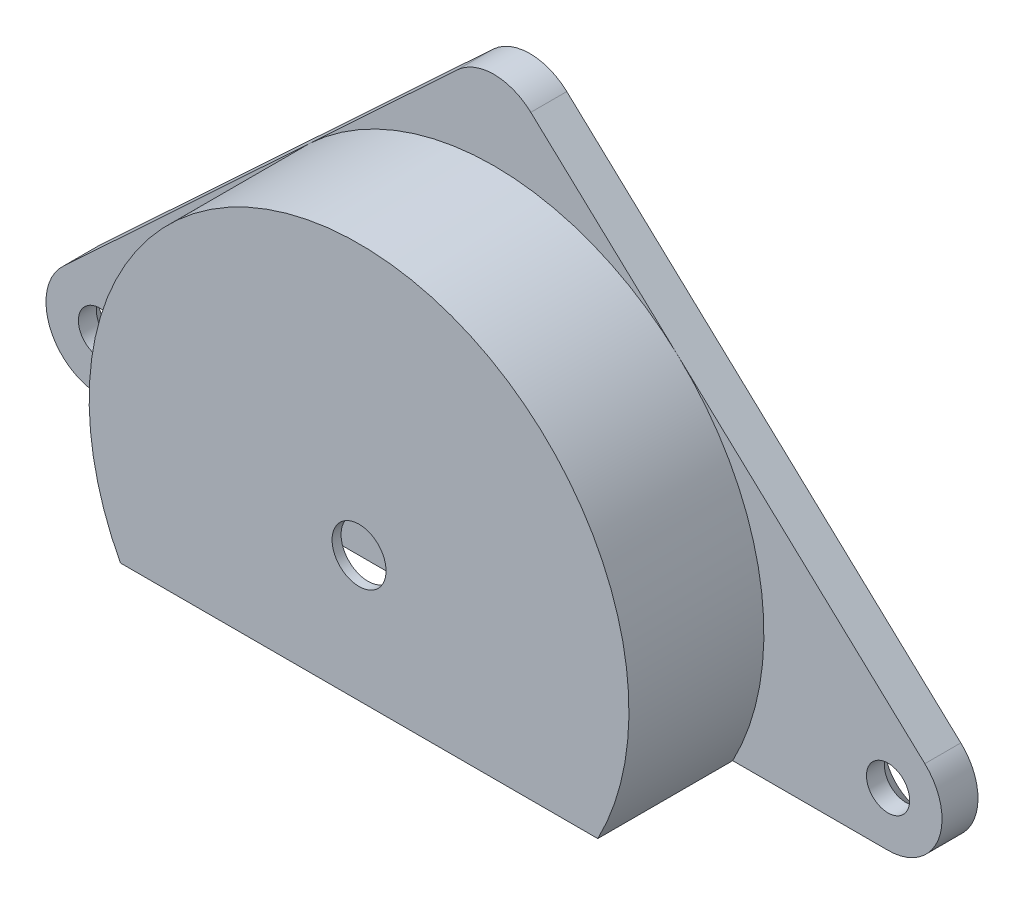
ISO-10303-21;
HEADER;
FILE_DESCRIPTION(('STEP AP214'),'2;1');
FILE_NAME('part.step','',(''),(''),'','','');
FILE_SCHEMA(('AUTOMOTIVE_DESIGN { 1 0 10303 214 1 1 1 1 }'));
ENDSEC;
DATA;
#1=APPLICATION_CONTEXT('core data for automotive mechanical design processes');
#2=APPLICATION_PROTOCOL_DEFINITION('international standard','automotive_design',2000,#1);
#3=PRODUCT_CONTEXT('',#1,'mechanical');
#4=PRODUCT('Part','Part','',(#3));
#5=PRODUCT_RELATED_PRODUCT_CATEGORY('part','',(#4));
#6=PRODUCT_DEFINITION_FORMATION('','',#4);
#7=PRODUCT_DEFINITION_CONTEXT('part definition',#1,'design');
#8=PRODUCT_DEFINITION('design','',#6,#7);
#9=PRODUCT_DEFINITION_SHAPE('','',#8);
#10=(LENGTH_UNIT() NAMED_UNIT(*) SI_UNIT(.MILLI.,.METRE.));
#11=(NAMED_UNIT(*) PLANE_ANGLE_UNIT() SI_UNIT($,.RADIAN.));
#12=(NAMED_UNIT(*) SI_UNIT($,.STERADIAN.) SOLID_ANGLE_UNIT());
#13=UNCERTAINTY_MEASURE_WITH_UNIT(LENGTH_MEASURE(1.E-05),#10,'distance_accuracy_value','');
#14=(GEOMETRIC_REPRESENTATION_CONTEXT(3) GLOBAL_UNCERTAINTY_ASSIGNED_CONTEXT((#13)) GLOBAL_UNIT_ASSIGNED_CONTEXT((#10,
#11,#12)) REPRESENTATION_CONTEXT('',''));
#15=CARTESIAN_POINT('',(0.,0.,0.));
#16=DIRECTION('',(0.,0.,1.));
#17=DIRECTION('',(1.,0.,0.));
#18=AXIS2_PLACEMENT_3D('',#15,#16,#17);
#19=CARTESIAN_POINT('',(-13.2664991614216,-7.,-3.75));
#20=DIRECTION('',(0.,1.,0.));
#21=DIRECTION('',(0.,0.,1.));
#22=AXIS2_PLACEMENT_3D('',#19,#20,#21);
#23=PLANE('',#22);
#24=DIRECTION('',(-1.,0.,0.));
#25=VECTOR('',#24,1.);
#26=CARTESIAN_POINT('',(29.5208210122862,-7.,-3.75));
#27=LINE('',#26,#25);
#28=CARTESIAN_POINT('',(-13.2664991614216,-7.,-3.75));
#29=VERTEX_POINT('',#28);
#30=CARTESIAN_POINT('',(-21.8990817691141,-7.,-3.75));
#31=VERTEX_POINT('',#30);
#32=EDGE_CURVE('E140',#29,#31,#27,.T.);
#33=ORIENTED_EDGE('',*,*,#32,.T.);
#34=DIRECTION('',(0.,0.,1.));
#35=VECTOR('',#34,1.);
#36=CARTESIAN_POINT('',(-21.8990817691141,-7.,-3.75));
#37=LINE('',#36,#35);
#38=CARTESIAN_POINT('',(-21.8990817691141,-7.,-5.75));
#39=VERTEX_POINT('',#38);
#40=EDGE_CURVE('E52',#31,#39,#37,.F.);
#41=ORIENTED_EDGE('',*,*,#40,.T.);
#42=DIRECTION('',(-1.,0.,0.));
#43=VECTOR('',#42,1.);
#44=CARTESIAN_POINT('',(29.5208210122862,-7.,-5.75));
#45=LINE('',#44,#43);
#46=CARTESIAN_POINT('',(21.8990817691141,-7.,-5.75));
#47=VERTEX_POINT('',#46);
#48=EDGE_CURVE('E187',#47,#39,#45,.T.);
#49=ORIENTED_EDGE('',*,*,#48,.F.);
#50=DIRECTION('',(0.,0.,1.));
#51=VECTOR('',#50,1.);
#52=CARTESIAN_POINT('',(21.8990817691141,-7.,-3.75));
#53=LINE('',#52,#51);
#54=CARTESIAN_POINT('',(21.8990817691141,-7.,-3.75));
#55=VERTEX_POINT('',#54);
#56=EDGE_CURVE('E181',#47,#55,#53,.T.);
#57=ORIENTED_EDGE('',*,*,#56,.T.);
#58=CARTESIAN_POINT('',(13.2664991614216,-7.,-3.75));
#59=VERTEX_POINT('',#58);
#60=EDGE_CURVE('E254',#55,#59,#27,.T.);
#61=ORIENTED_EDGE('',*,*,#60,.T.);
#62=DIRECTION('',(0.,0.,1.));
#63=VECTOR('',#62,1.);
#64=CARTESIAN_POINT('',(13.2664991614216,-7.,-3.75));
#65=LINE('',#64,#63);
#66=CARTESIAN_POINT('',(13.2664991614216,-7.,3.75));
#67=VERTEX_POINT('',#66);
#68=EDGE_CURVE('E235',#59,#67,#65,.T.);
#69=ORIENTED_EDGE('',*,*,#68,.T.);
#70=DIRECTION('',(-1.,0.,0.));
#71=VECTOR('',#70,1.);
#72=CARTESIAN_POINT('',(-13.2664991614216,-7.,3.75));
#73=LINE('',#72,#71);
#74=CARTESIAN_POINT('',(-13.2664991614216,-7.,3.75));
#75=VERTEX_POINT('',#74);
#76=EDGE_CURVE('E234',#67,#75,#73,.T.);
#77=ORIENTED_EDGE('',*,*,#76,.T.);
#78=DIRECTION('',(0.,0.,1.));
#79=VECTOR('',#78,1.);
#80=CARTESIAN_POINT('',(-13.2664991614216,-7.,-3.75));
#81=LINE('',#80,#79);
#82=EDGE_CURVE('E146',#29,#75,#81,.T.);
#83=ORIENTED_EDGE('',*,*,#82,.F.);
#84=EDGE_LOOP('',(#33,#41,#49,#57,#61,#69,#77,#83));
#85=FACE_BOUND('',#84,.T.);
#86=DIRECTION('',(-1.,0.,0.));
#87=VECTOR('',#86,1.);
#88=CARTESIAN_POINT('',(0.,-7.,3.25));
#89=LINE('',#88,#87);
#90=CARTESIAN_POINT('',(12.6984250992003,-7.,3.25));
#91=VERTEX_POINT('',#90);
#92=CARTESIAN_POINT('',(-12.6984250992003,-7.,3.25));
#93=VERTEX_POINT('',#92);
#94=EDGE_CURVE('E195',#91,#93,#89,.T.);
#95=ORIENTED_EDGE('',*,*,#94,.F.);
#96=DIRECTION('',(0.,0.,-1.));
#97=VECTOR('',#96,1.);
#98=CARTESIAN_POINT('',(12.6984250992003,-7.,-3.25));
#99=LINE('',#98,#97);
#100=CARTESIAN_POINT('',(12.6984250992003,-7.,-3.25));
#101=VERTEX_POINT('',#100);
#102=EDGE_CURVE('E243',#101,#91,#99,.F.);
#103=ORIENTED_EDGE('',*,*,#102,.F.);
#104=DIRECTION('',(-1.,0.,0.));
#105=VECTOR('',#104,1.);
#106=CARTESIAN_POINT('',(0.,-7.,-3.25));
#107=LINE('',#106,#105);
#108=CARTESIAN_POINT('',(-12.6984250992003,-7.,-3.25));
#109=VERTEX_POINT('',#108);
#110=EDGE_CURVE('E240',#101,#109,#107,.T.);
#111=ORIENTED_EDGE('',*,*,#110,.T.);
#112=DIRECTION('',(0.,0.,-1.));
#113=VECTOR('',#112,1.);
#114=CARTESIAN_POINT('',(-12.6984250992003,-7.,-3.25));
#115=LINE('',#114,#113);
#116=EDGE_CURVE('E244',#109,#93,#115,.F.);
#117=ORIENTED_EDGE('',*,*,#116,.T.);
#118=EDGE_LOOP('',(#95,#103,#111,#117));
#119=FACE_BOUND('',#118,.T.);
#120=ADVANCED_FACE('F44',(#85,#119),#23,.F.);
#121=CARTESIAN_POINT('',(0.,0.,3.75));
#122=DIRECTION('',(0.,0.,-1.));
#123=DIRECTION('',(-1.,0.,0.));
#124=AXIS2_PLACEMENT_3D('',#121,#122,#123);
#125=CYLINDRICAL_SURFACE('',#124,15.);
#126=CARTESIAN_POINT('',(0.,0.,3.75));
#127=DIRECTION('',(0.,0.,1.));
#128=DIRECTION('',(1.,0.,0.));
#129=AXIS2_PLACEMENT_3D('',#126,#127,#128);
#130=CIRCLE('',#129,15.);
#131=EDGE_CURVE('E161',#67,#75,#130,.T.);
#132=ORIENTED_EDGE('',*,*,#131,.F.);
#133=ORIENTED_EDGE('',*,*,#68,.F.);
#134=CARTESIAN_POINT('',(0.,0.,-3.75));
#135=DIRECTION('',(0.,0.,1.));
#136=DIRECTION('',(1.,0.,0.));
#137=AXIS2_PLACEMENT_3D('',#134,#135,#136);
#138=CIRCLE('',#137,15.);
#139=CARTESIAN_POINT('',(10.2242843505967,10.9756097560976,-3.75));
#140=VERTEX_POINT('',#139);
#141=EDGE_CURVE('E148',#59,#140,#138,.T.);
#142=ORIENTED_EDGE('',*,*,#141,.T.);
#143=CARTESIAN_POINT('',(-10.2242843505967,10.9756097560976,-3.75));
#144=VERTEX_POINT('',#143);
#145=EDGE_CURVE('E145',#140,#144,#138,.T.);
#146=ORIENTED_EDGE('',*,*,#145,.T.);
#147=EDGE_CURVE('E138',#144,#29,#138,.T.);
#148=ORIENTED_EDGE('',*,*,#147,.T.);
#149=ORIENTED_EDGE('',*,*,#82,.T.);
#150=EDGE_LOOP('',(#132,#133,#142,#146,#148,#149));
#151=FACE_BOUND('',#150,.T.);
#152=ADVANCED_FACE('F158',(#151),#125,.T.);
#153=CARTESIAN_POINT('',(0.,0.,3.75));
#154=DIRECTION('',(0.,0.,1.));
#155=DIRECTION('',(1.,0.,0.));
#156=AXIS2_PLACEMENT_3D('',#153,#154,#155);
#157=PLANE('',#156);
#158=CARTESIAN_POINT('',(0.,0.,3.75));
#159=DIRECTION('',(0.,0.,1.));
#160=DIRECTION('',(1.,0.,0.));
#161=AXIS2_PLACEMENT_3D('',#158,#159,#160);
#162=CIRCLE('',#161,1.5);
#163=CARTESIAN_POINT('',(1.5,0.,3.75));
#164=VERTEX_POINT('',#163);
#165=EDGE_CURVE('E231',#164,#164,#162,.T.);
#166=ORIENTED_EDGE('',*,*,#165,.F.);
#167=EDGE_LOOP('',(#166));
#168=FACE_BOUND('',#167,.T.);
#169=ORIENTED_EDGE('',*,*,#76,.F.);
#170=ORIENTED_EDGE('',*,*,#131,.T.);
#171=EDGE_LOOP('',(#169,#170));
#172=FACE_BOUND('',#171,.T.);
#173=ADVANCED_FACE('F213',(#168,#172),#157,.T.);
#174=CARTESIAN_POINT('',(0.,0.,3.75));
#175=DIRECTION('',(0.,0.,-1.));
#176=DIRECTION('',(-1.,0.,0.));
#177=AXIS2_PLACEMENT_3D('',#174,#175,#176);
#178=CYLINDRICAL_SURFACE('',#177,14.5);
#179=CARTESIAN_POINT('',(0.,0.,3.25));
#180=DIRECTION('',(0.,0.,1.));
#181=DIRECTION('',(1.,0.,0.));
#182=AXIS2_PLACEMENT_3D('',#179,#180,#181);
#183=CIRCLE('',#182,14.5);
#184=EDGE_CURVE('E236',#91,#93,#183,.T.);
#185=ORIENTED_EDGE('',*,*,#184,.T.);
#186=ORIENTED_EDGE('',*,*,#116,.F.);
#187=CARTESIAN_POINT('',(0.,0.,-3.25));
#188=DIRECTION('',(0.,0.,1.));
#189=DIRECTION('',(1.,0.,0.));
#190=AXIS2_PLACEMENT_3D('',#187,#188,#189);
#191=CIRCLE('',#190,14.5);
#192=EDGE_CURVE('E247',#101,#109,#191,.T.);
#193=ORIENTED_EDGE('',*,*,#192,.F.);
#194=ORIENTED_EDGE('',*,*,#102,.T.);
#195=EDGE_LOOP('',(#185,#186,#193,#194));
#196=FACE_BOUND('',#195,.T.);
#197=ADVANCED_FACE('F220',(#196),#178,.F.);
#198=CARTESIAN_POINT('',(0.,0.,3.25));
#199=DIRECTION('',(0.,0.,1.));
#200=DIRECTION('',(1.,0.,0.));
#201=AXIS2_PLACEMENT_3D('',#198,#199,#200);
#202=PLANE('',#201);
#203=CARTESIAN_POINT('',(0.,0.,3.25));
#204=DIRECTION('',(0.,0.,1.));
#205=DIRECTION('',(1.,0.,0.));
#206=AXIS2_PLACEMENT_3D('',#203,#204,#205);
#207=CIRCLE('',#206,1.5);
#208=CARTESIAN_POINT('',(1.5,0.,3.25));
#209=VERTEX_POINT('',#208);
#210=EDGE_CURVE('E278',#209,#209,#207,.T.);
#211=ORIENTED_EDGE('',*,*,#210,.T.);
#212=EDGE_LOOP('',(#211));
#213=FACE_BOUND('',#212,.T.);
#214=ORIENTED_EDGE('',*,*,#94,.T.);
#215=ORIENTED_EDGE('',*,*,#184,.F.);
#216=EDGE_LOOP('',(#214,#215));
#217=FACE_BOUND('',#216,.T.);
#218=ADVANCED_FACE('F225',(#213,#217),#202,.F.);
#219=CARTESIAN_POINT('',(0.,0.,-3.25));
#220=DIRECTION('',(0.,0.,1.));
#221=DIRECTION('',(1.,0.,0.));
#222=AXIS2_PLACEMENT_3D('',#219,#220,#221);
#223=PLANE('',#222);
#224=CARTESIAN_POINT('',(0.,0.,-3.25));
#225=DIRECTION('',(0.,0.,1.));
#226=DIRECTION('',(1.,0.,0.));
#227=AXIS2_PLACEMENT_3D('',#224,#225,#226);
#228=CIRCLE('',#227,1.5);
#229=CARTESIAN_POINT('',(1.5,0.,-3.25));
#230=VERTEX_POINT('',#229);
#231=EDGE_CURVE('E281',#230,#230,#228,.T.);
#232=ORIENTED_EDGE('',*,*,#231,.F.);
#233=EDGE_LOOP('',(#232));
#234=FACE_BOUND('',#233,.T.);
#235=ORIENTED_EDGE('',*,*,#192,.T.);
#236=ORIENTED_EDGE('',*,*,#110,.F.);
#237=EDGE_LOOP('',(#235,#236));
#238=FACE_BOUND('',#237,.T.);
#239=ADVANCED_FACE('F217',(#234,#238),#223,.T.);
#240=CARTESIAN_POINT('',(0.,0.,-3.75));
#241=DIRECTION('',(0.,0.,-1.));
#242=DIRECTION('',(-1.,0.,0.));
#243=AXIS2_PLACEMENT_3D('',#240,#241,#242);
#244=PLANE('',#243);
#245=CARTESIAN_POINT('',(21.8990817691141,-4.,-3.75));
#246=DIRECTION('',(0.,0.,-1.));
#247=DIRECTION('',(-1.,0.,0.));
#248=AXIS2_PLACEMENT_3D('',#245,#246,#247);
#249=CIRCLE('',#248,1.2);
#250=CARTESIAN_POINT('',(20.6990817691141,-4.,-3.75));
#251=VERTEX_POINT('',#250);
#252=EDGE_CURVE('E269',#251,#251,#249,.T.);
#253=ORIENTED_EDGE('',*,*,#252,.T.);
#254=EDGE_LOOP('',(#253));
#255=FACE_BOUND('',#254,.T.);
#256=ORIENTED_EDGE('',*,*,#60,.F.);
#257=CARTESIAN_POINT('',(21.8990817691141,-4.,-3.75));
#258=DIRECTION('',(0.,0.,-1.));
#259=DIRECTION('',(-1.,0.,0.));
#260=AXIS2_PLACEMENT_3D('',#257,#258,#259);
#261=CIRCLE('',#260,3.);
#262=CARTESIAN_POINT('',(23.9439386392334,-1.80487804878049,-3.75));
#263=VERTEX_POINT('',#262);
#264=EDGE_CURVE('E13',#55,#263,#261,.F.);
#265=ORIENTED_EDGE('',*,*,#264,.T.);
#266=DIRECTION('',(0.731707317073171,-0.681618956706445,0.));
#267=VECTOR('',#266,1.);
#268=CARTESIAN_POINT('',(29.5208210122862,-7.,-3.75));
#269=LINE('',#268,#267);
#270=EDGE_CURVE('E135',#140,#263,#269,.T.);
#271=ORIENTED_EDGE('',*,*,#270,.F.);
#272=ORIENTED_EDGE('',*,*,#141,.F.);
#273=EDGE_LOOP('',(#256,#265,#271,#272));
#274=FACE_BOUND('',#273,.T.);
#275=ADVANCED_FACE('F322',(#255,#274),#244,.F.);
#276=CARTESIAN_POINT('',(2.04485687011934,18.5951219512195,-3.75));
#277=VERTEX_POINT('',#276);
#278=EDGE_CURVE('E257',#277,#140,#269,.T.);
#279=ORIENTED_EDGE('',*,*,#278,.F.);
#280=CARTESIAN_POINT('',(0.,16.4,-3.75));
#281=DIRECTION('',(0.,0.,-1.));
#282=DIRECTION('',(-1.,0.,0.));
#283=AXIS2_PLACEMENT_3D('',#280,#281,#282);
#284=CIRCLE('',#283,3.);
#285=CARTESIAN_POINT('',(-2.04485687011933,18.5951219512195,-3.75));
#286=VERTEX_POINT('',#285);
#287=EDGE_CURVE('E154',#277,#286,#284,.F.);
#288=ORIENTED_EDGE('',*,*,#287,.T.);
#289=DIRECTION('',(0.73170731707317,0.681618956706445,0.));
#290=VECTOR('',#289,1.);
#291=CARTESIAN_POINT('',(0.,20.5,-3.75));
#292=LINE('',#291,#290);
#293=EDGE_CURVE('E130',#144,#286,#292,.T.);
#294=ORIENTED_EDGE('',*,*,#293,.F.);
#295=ORIENTED_EDGE('',*,*,#145,.F.);
#296=EDGE_LOOP('',(#279,#288,#294,#295));
#297=FACE_BOUND('',#296,.T.);
#298=ADVANCED_FACE('F152',(#297),#244,.F.);
#299=CARTESIAN_POINT('',(0.,20.5,-5.75));
#300=DIRECTION('',(0.681618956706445,-0.731707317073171,0.));
#301=DIRECTION('',(0.731707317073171,0.681618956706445,0.));
#302=AXIS2_PLACEMENT_3D('',#299,#300,#301);
#303=PLANE('',#302);
#304=ORIENTED_EDGE('',*,*,#293,.T.);
#305=DIRECTION('',(0.,0.,1.));
#306=VECTOR('',#305,1.);
#307=CARTESIAN_POINT('',(-2.04485687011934,18.5951219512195,-5.75));
#308=LINE('',#307,#306);
#309=CARTESIAN_POINT('',(-2.04485687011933,18.5951219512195,-5.75));
#310=VERTEX_POINT('',#309);
#311=EDGE_CURVE('E172',#286,#310,#308,.F.);
#312=ORIENTED_EDGE('',*,*,#311,.T.);
#313=DIRECTION('',(0.73170731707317,0.681618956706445,0.));
#314=VECTOR('',#313,1.);
#315=CARTESIAN_POINT('',(0.,20.5,-5.75));
#316=LINE('',#315,#314);
#317=CARTESIAN_POINT('',(-23.9439386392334,-1.80487804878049,-5.75));
#318=VERTEX_POINT('',#317);
#319=EDGE_CURVE('E256',#318,#310,#316,.T.);
#320=ORIENTED_EDGE('',*,*,#319,.F.);
#321=DIRECTION('',(0.,0.,1.));
#322=VECTOR('',#321,1.);
#323=CARTESIAN_POINT('',(-23.9439386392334,-1.80487804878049,-5.75));
#324=LINE('',#323,#322);
#325=CARTESIAN_POINT('',(-23.9439386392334,-1.80487804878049,-3.75));
#326=VERTEX_POINT('',#325);
#327=EDGE_CURVE('E134',#318,#326,#324,.T.);
#328=ORIENTED_EDGE('',*,*,#327,.T.);
#329=EDGE_CURVE('E126',#326,#144,#292,.T.);
#330=ORIENTED_EDGE('',*,*,#329,.T.);
#331=EDGE_LOOP('',(#304,#312,#320,#328,#330));
#332=FACE_BOUND('',#331,.T.);
#333=ADVANCED_FACE('F128',(#332),#303,.F.);
#334=CARTESIAN_POINT('',(29.5208210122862,-7.,-5.75));
#335=DIRECTION('',(-0.681618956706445,-0.731707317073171,0.));
#336=DIRECTION('',(0.731707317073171,-0.681618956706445,0.));
#337=AXIS2_PLACEMENT_3D('',#334,#335,#336);
#338=PLANE('',#337);
#339=DIRECTION('',(0.731707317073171,-0.681618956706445,0.));
#340=VECTOR('',#339,1.);
#341=CARTESIAN_POINT('',(29.5208210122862,-7.,-5.75));
#342=LINE('',#341,#340);
#343=CARTESIAN_POINT('',(2.04485687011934,18.5951219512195,-5.75));
#344=VERTEX_POINT('',#343);
#345=CARTESIAN_POINT('',(23.9439386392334,-1.80487804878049,-5.75));
#346=VERTEX_POINT('',#345);
#347=EDGE_CURVE('E196',#344,#346,#342,.T.);
#348=ORIENTED_EDGE('',*,*,#347,.F.);
#349=DIRECTION('',(0.,0.,1.));
#350=VECTOR('',#349,1.);
#351=CARTESIAN_POINT('',(2.04485687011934,18.5951219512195,-5.75));
#352=LINE('',#351,#350);
#353=EDGE_CURVE('E167',#344,#277,#352,.T.);
#354=ORIENTED_EDGE('',*,*,#353,.T.);
#355=ORIENTED_EDGE('',*,*,#278,.T.);
#356=ORIENTED_EDGE('',*,*,#270,.T.);
#357=DIRECTION('',(0.,0.,1.));
#358=VECTOR('',#357,1.);
#359=CARTESIAN_POINT('',(23.9439386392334,-1.80487804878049,-5.75));
#360=LINE('',#359,#358);
#361=EDGE_CURVE('E165',#263,#346,#360,.F.);
#362=ORIENTED_EDGE('',*,*,#361,.T.);
#363=EDGE_LOOP('',(#348,#354,#355,#356,#362));
#364=FACE_BOUND('',#363,.T.);
#365=ADVANCED_FACE('F318',(#364),#338,.F.);
#366=CARTESIAN_POINT('',(0.,0.,-5.75));
#367=DIRECTION('',(0.,0.,-1.));
#368=DIRECTION('',(-1.,0.,0.));
#369=AXIS2_PLACEMENT_3D('',#366,#367,#368);
#370=PLANE('',#369);
#371=CARTESIAN_POINT('',(0.,0.,-5.75));
#372=DIRECTION('',(0.,0.,1.));
#373=DIRECTION('',(1.,0.,0.));
#374=AXIS2_PLACEMENT_3D('',#371,#372,#373);
#375=CIRCLE('',#374,1.5);
#376=CARTESIAN_POINT('',(1.5,0.,-5.75));
#377=VERTEX_POINT('',#376);
#378=EDGE_CURVE('E284',#377,#377,#375,.T.);
#379=ORIENTED_EDGE('',*,*,#378,.T.);
#380=EDGE_LOOP('',(#379));
#381=FACE_BOUND('',#380,.T.);
#382=CARTESIAN_POINT('',(21.8990817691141,-4.,-5.75));
#383=DIRECTION('',(0.,0.,-1.));
#384=DIRECTION('',(-1.,0.,0.));
#385=AXIS2_PLACEMENT_3D('',#382,#383,#384);
#386=CIRCLE('',#385,2.2);
#387=CARTESIAN_POINT('',(19.6990817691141,-4.,-5.75));
#388=VERTEX_POINT('',#387);
#389=EDGE_CURVE('E275',#388,#388,#386,.T.);
#390=ORIENTED_EDGE('',*,*,#389,.F.);
#391=EDGE_LOOP('',(#390));
#392=FACE_BOUND('',#391,.T.);
#393=CARTESIAN_POINT('',(-21.8990817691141,-4.,-5.75));
#394=DIRECTION('',(0.,0.,-1.));
#395=DIRECTION('',(-1.,0.,0.));
#396=AXIS2_PLACEMENT_3D('',#393,#394,#395);
#397=CIRCLE('',#396,2.2);
#398=CARTESIAN_POINT('',(-24.0990817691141,-4.,-5.75));
#399=VERTEX_POINT('',#398);
#400=EDGE_CURVE('E266',#399,#399,#397,.T.);
#401=ORIENTED_EDGE('',*,*,#400,.F.);
#402=EDGE_LOOP('',(#401));
#403=FACE_BOUND('',#402,.T.);
#404=ORIENTED_EDGE('',*,*,#319,.T.);
#405=CARTESIAN_POINT('',(0.,16.4,-5.75));
#406=DIRECTION('',(0.,0.,-1.));
#407=DIRECTION('',(-1.,0.,0.));
#408=AXIS2_PLACEMENT_3D('',#405,#406,#407);
#409=CIRCLE('',#408,3.);
#410=EDGE_CURVE('E178',#310,#344,#409,.T.);
#411=ORIENTED_EDGE('',*,*,#410,.T.);
#412=ORIENTED_EDGE('',*,*,#347,.T.);
#413=CARTESIAN_POINT('',(21.8990817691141,-4.,-5.75));
#414=DIRECTION('',(0.,0.,-1.));
#415=DIRECTION('',(-1.,0.,0.));
#416=AXIS2_PLACEMENT_3D('',#413,#414,#415);
#417=CIRCLE('',#416,3.);
#418=EDGE_CURVE('E174',#346,#47,#417,.T.);
#419=ORIENTED_EDGE('',*,*,#418,.T.);
#420=ORIENTED_EDGE('',*,*,#48,.T.);
#421=CARTESIAN_POINT('',(-21.8990817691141,-4.,-5.75));
#422=DIRECTION('',(0.,0.,-1.));
#423=DIRECTION('',(-1.,0.,0.));
#424=AXIS2_PLACEMENT_3D('',#421,#422,#423);
#425=CIRCLE('',#424,3.);
#426=EDGE_CURVE('E176',#39,#318,#425,.T.);
#427=ORIENTED_EDGE('',*,*,#426,.T.);
#428=EDGE_LOOP('',(#404,#411,#412,#419,#420,#427));
#429=FACE_BOUND('',#428,.T.);
#430=ADVANCED_FACE('F192',(#381,#392,#403,#429),#370,.T.);
#431=CARTESIAN_POINT('',(-21.8990817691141,-4.,-3.75));
#432=DIRECTION('',(0.,0.,-1.));
#433=DIRECTION('',(-1.,0.,0.));
#434=AXIS2_PLACEMENT_3D('',#431,#432,#433);
#435=CIRCLE('',#434,1.2);
#436=CARTESIAN_POINT('',(-23.0990817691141,-4.,-3.75));
#437=VERTEX_POINT('',#436);
#438=EDGE_CURVE('E155',#437,#437,#435,.T.);
#439=ORIENTED_EDGE('',*,*,#438,.T.);
#440=EDGE_LOOP('',(#439));
#441=FACE_BOUND('',#440,.T.);
#442=ORIENTED_EDGE('',*,*,#329,.F.);
#443=CARTESIAN_POINT('',(-21.8990817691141,-4.,-3.75));
#444=DIRECTION('',(0.,0.,-1.));
#445=DIRECTION('',(-1.,0.,0.));
#446=AXIS2_PLACEMENT_3D('',#443,#444,#445);
#447=CIRCLE('',#446,3.);
#448=EDGE_CURVE('E65',#326,#31,#447,.F.);
#449=ORIENTED_EDGE('',*,*,#448,.T.);
#450=ORIENTED_EDGE('',*,*,#32,.F.);
#451=ORIENTED_EDGE('',*,*,#147,.F.);
#452=EDGE_LOOP('',(#442,#449,#450,#451));
#453=FACE_BOUND('',#452,.T.);
#454=ADVANCED_FACE('F139',(#441,#453),#244,.F.);
#455=CARTESIAN_POINT('',(0.,16.4,-5.75));
#456=DIRECTION('',(0.,0.,1.));
#457=DIRECTION('',(1.,0.,0.));
#458=AXIS2_PLACEMENT_3D('',#455,#456,#457);
#459=CYLINDRICAL_SURFACE('',#458,3.);
#460=ORIENTED_EDGE('',*,*,#410,.F.);
#461=ORIENTED_EDGE('',*,*,#311,.F.);
#462=ORIENTED_EDGE('',*,*,#287,.F.);
#463=ORIENTED_EDGE('',*,*,#353,.F.);
#464=EDGE_LOOP('',(#460,#461,#462,#463));
#465=FACE_BOUND('',#464,.T.);
#466=ADVANCED_FACE('F200',(#465),#459,.T.);
#467=CARTESIAN_POINT('',(-21.8990817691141,-4.,-5.75));
#468=DIRECTION('',(0.,0.,1.));
#469=DIRECTION('',(1.,0.,0.));
#470=AXIS2_PLACEMENT_3D('',#467,#468,#469);
#471=CYLINDRICAL_SURFACE('',#470,3.);
#472=ORIENTED_EDGE('',*,*,#426,.F.);
#473=ORIENTED_EDGE('',*,*,#40,.F.);
#474=ORIENTED_EDGE('',*,*,#448,.F.);
#475=ORIENTED_EDGE('',*,*,#327,.F.);
#476=EDGE_LOOP('',(#472,#473,#474,#475));
#477=FACE_BOUND('',#476,.T.);
#478=ADVANCED_FACE('F198',(#477),#471,.T.);
#479=CARTESIAN_POINT('',(21.8990817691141,-4.,-3.75));
#480=DIRECTION('',(0.,0.,1.));
#481=DIRECTION('',(1.,0.,0.));
#482=AXIS2_PLACEMENT_3D('',#479,#480,#481);
#483=CYLINDRICAL_SURFACE('',#482,3.);
#484=ORIENTED_EDGE('',*,*,#418,.F.);
#485=ORIENTED_EDGE('',*,*,#361,.F.);
#486=ORIENTED_EDGE('',*,*,#264,.F.);
#487=ORIENTED_EDGE('',*,*,#56,.F.);
#488=EDGE_LOOP('',(#484,#485,#486,#487));
#489=FACE_BOUND('',#488,.T.);
#490=ADVANCED_FACE('F46',(#489),#483,.T.);
#491=CARTESIAN_POINT('',(-21.8990817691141,-4.,-5.75));
#492=DIRECTION('',(0.,0.,-1.));
#493=DIRECTION('',(-1.,0.,0.));
#494=AXIS2_PLACEMENT_3D('',#491,#492,#493);
#495=CYLINDRICAL_SURFACE('',#494,1.2);
#496=ORIENTED_EDGE('',*,*,#438,.F.);
#497=EDGE_LOOP('',(#496));
#498=FACE_BOUND('',#497,.T.);
#499=CARTESIAN_POINT('',(-21.8990817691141,-4.,-4.75));
#500=DIRECTION('',(0.,0.,-1.));
#501=DIRECTION('',(-1.,0.,0.));
#502=AXIS2_PLACEMENT_3D('',#499,#500,#501);
#503=CIRCLE('',#502,1.2);
#504=CARTESIAN_POINT('',(-23.0990817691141,-4.,-4.75));
#505=VERTEX_POINT('',#504);
#506=EDGE_CURVE('E263',#505,#505,#503,.T.);
#507=ORIENTED_EDGE('',*,*,#506,.T.);
#508=EDGE_LOOP('',(#507));
#509=FACE_BOUND('',#508,.T.);
#510=ADVANCED_FACE('F205',(#498,#509),#495,.F.);
#511=CARTESIAN_POINT('',(-21.8990817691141,-4.,-5.75));
#512=DIRECTION('',(0.,0.,-1.));
#513=DIRECTION('',(-1.,0.,0.));
#514=AXIS2_PLACEMENT_3D('',#511,#512,#513);
#515=CONICAL_SURFACE('',#514,2.2,0.785398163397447);
#516=ORIENTED_EDGE('',*,*,#506,.F.);
#517=EDGE_LOOP('',(#516));
#518=FACE_BOUND('',#517,.T.);
#519=ORIENTED_EDGE('',*,*,#400,.T.);
#520=EDGE_LOOP('',(#519));
#521=FACE_BOUND('',#520,.T.);
#522=ADVANCED_FACE('F308',(#518,#521),#515,.F.);
#523=CARTESIAN_POINT('',(21.8990817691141,-4.,-5.75));
#524=DIRECTION('',(0.,0.,-1.));
#525=DIRECTION('',(-1.,0.,0.));
#526=AXIS2_PLACEMENT_3D('',#523,#524,#525);
#527=CYLINDRICAL_SURFACE('',#526,1.2);
#528=ORIENTED_EDGE('',*,*,#252,.F.);
#529=EDGE_LOOP('',(#528));
#530=FACE_BOUND('',#529,.T.);
#531=CARTESIAN_POINT('',(21.8990817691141,-4.,-4.75));
#532=DIRECTION('',(0.,0.,-1.));
#533=DIRECTION('',(-1.,0.,0.));
#534=AXIS2_PLACEMENT_3D('',#531,#532,#533);
#535=CIRCLE('',#534,1.2);
#536=CARTESIAN_POINT('',(20.6990817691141,-4.,-4.75));
#537=VERTEX_POINT('',#536);
#538=EDGE_CURVE('E272',#537,#537,#535,.T.);
#539=ORIENTED_EDGE('',*,*,#538,.T.);
#540=EDGE_LOOP('',(#539));
#541=FACE_BOUND('',#540,.T.);
#542=ADVANCED_FACE('F302',(#530,#541),#527,.F.);
#543=CARTESIAN_POINT('',(21.8990817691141,-4.,-5.75));
#544=DIRECTION('',(0.,0.,-1.));
#545=DIRECTION('',(-1.,0.,0.));
#546=AXIS2_PLACEMENT_3D('',#543,#544,#545);
#547=CONICAL_SURFACE('',#546,2.2,0.785398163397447);
#548=ORIENTED_EDGE('',*,*,#538,.F.);
#549=EDGE_LOOP('',(#548));
#550=FACE_BOUND('',#549,.T.);
#551=ORIENTED_EDGE('',*,*,#389,.T.);
#552=EDGE_LOOP('',(#551));
#553=FACE_BOUND('',#552,.T.);
#554=ADVANCED_FACE('F294',(#550,#553),#547,.F.);
#555=CARTESIAN_POINT('',(0.,0.,-5.75));
#556=DIRECTION('',(0.,0.,1.));
#557=DIRECTION('',(1.,0.,0.));
#558=AXIS2_PLACEMENT_3D('',#555,#556,#557);
#559=CYLINDRICAL_SURFACE('',#558,1.5);
#560=ORIENTED_EDGE('',*,*,#231,.T.);
#561=EDGE_LOOP('',(#560));
#562=FACE_BOUND('',#561,.T.);
#563=ORIENTED_EDGE('',*,*,#378,.F.);
#564=EDGE_LOOP('',(#563));
#565=FACE_BOUND('',#564,.T.);
#566=ADVANCED_FACE('F291',(#562,#565),#559,.F.);
#567=ORIENTED_EDGE('',*,*,#165,.T.);
#568=EDGE_LOOP('',(#567));
#569=FACE_BOUND('',#568,.T.);
#570=ORIENTED_EDGE('',*,*,#210,.F.);
#571=EDGE_LOOP('',(#570));
#572=FACE_BOUND('',#571,.T.);
#573=ADVANCED_FACE('F293',(#569,#572),#559,.F.);
#574=CLOSED_SHELL('',(#120,#152,#173,#197,#218,#239,#275,#298,#333,#365,#430,#454,#466,#478,
#490,#510,#522,#542,#554,#566,#573));
#575=MANIFOLD_SOLID_BREP('B2',#574);
#576=ADVANCED_BREP_SHAPE_REPRESENTATION('',(#18,#575),#14);
#577=SHAPE_DEFINITION_REPRESENTATION(#9,#576);
ENDSEC;
END-ISO-10303-21;
